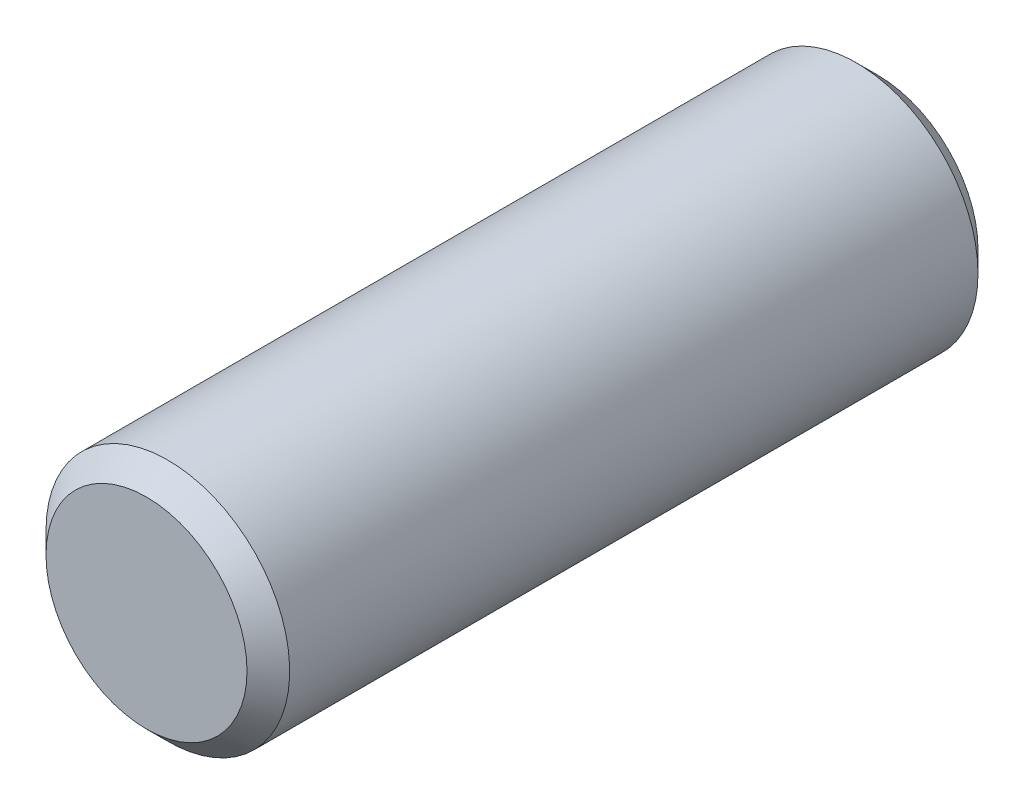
ISO-10303-21;
HEADER;
FILE_DESCRIPTION(('STEP AP214'),'2;1');
FILE_NAME('part.step','',(''),(''),'','','');
FILE_SCHEMA(('AUTOMOTIVE_DESIGN { 1 0 10303 214 1 1 1 1 }'));
ENDSEC;
DATA;
#1=APPLICATION_CONTEXT('core data for automotive mechanical design processes');
#2=APPLICATION_PROTOCOL_DEFINITION('international standard','automotive_design',2000,#1);
#3=PRODUCT_CONTEXT('',#1,'mechanical');
#4=PRODUCT('Part','Part','',(#3));
#5=PRODUCT_RELATED_PRODUCT_CATEGORY('part','',(#4));
#6=PRODUCT_DEFINITION_FORMATION('','',#4);
#7=PRODUCT_DEFINITION_CONTEXT('part definition',#1,'design');
#8=PRODUCT_DEFINITION('design','',#6,#7);
#9=PRODUCT_DEFINITION_SHAPE('','',#8);
#10=(LENGTH_UNIT() NAMED_UNIT(*) SI_UNIT(.MILLI.,.METRE.));
#11=(NAMED_UNIT(*) PLANE_ANGLE_UNIT() SI_UNIT($,.RADIAN.));
#12=(NAMED_UNIT(*) SI_UNIT($,.STERADIAN.) SOLID_ANGLE_UNIT());
#13=UNCERTAINTY_MEASURE_WITH_UNIT(LENGTH_MEASURE(1.E-05),#10,'distance_accuracy_value','');
#14=(GEOMETRIC_REPRESENTATION_CONTEXT(3) GLOBAL_UNCERTAINTY_ASSIGNED_CONTEXT((#13)) GLOBAL_UNIT_ASSIGNED_CONTEXT((#10,
#11,#12)) REPRESENTATION_CONTEXT('',''));
#15=CARTESIAN_POINT('',(0.,0.,0.));
#16=DIRECTION('',(0.,0.,1.));
#17=DIRECTION('',(1.,0.,0.));
#18=AXIS2_PLACEMENT_3D('',#15,#16,#17);
#19=CARTESIAN_POINT('',(0.,0.,12.));
#20=DIRECTION('',(0.,0.,-1.));
#21=DIRECTION('',(-1.,0.,0.));
#22=AXIS2_PLACEMENT_3D('',#19,#20,#21);
#23=CYLINDRICAL_SURFACE('',#22,2.);
#24=CARTESIAN_POINT('',(0.,0.,0.35));
#25=DIRECTION('',(0.,0.,1.));
#26=DIRECTION('',(1.,0.,0.));
#27=AXIS2_PLACEMENT_3D('',#24,#25,#26);
#28=CIRCLE('',#27,2.);
#29=CARTESIAN_POINT('',(-2.,0.,0.35));
#30=VERTEX_POINT('',#29);
#31=EDGE_CURVE('E39',#30,#30,#28,.T.);
#32=CARTESIAN_POINT('',(0.,0.,11.65));
#33=DIRECTION('',(0.,0.,1.));
#34=DIRECTION('',(1.,0.,0.));
#35=AXIS2_PLACEMENT_3D('',#32,#33,#34);
#36=CIRCLE('',#35,2.);
#37=CARTESIAN_POINT('',(-2.,0.,11.65));
#38=VERTEX_POINT('',#37);
#39=EDGE_CURVE('E43',#38,#38,#36,.F.);
#40=CARTESIAN_POINT('',(-2.,0.,0.35));
#41=CARTESIAN_POINT('',(-2.,0.,0.467708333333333));
#42=CARTESIAN_POINT('',(-2.,0.,0.585416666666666));
#43=CARTESIAN_POINT('',(-2.,0.,0.820833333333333));
#44=CARTESIAN_POINT('',(-2.,0.,0.938541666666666));
#45=CARTESIAN_POINT('',(-2.,0.,1.17395833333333));
#46=CARTESIAN_POINT('',(-2.,0.,1.29166666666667));
#47=CARTESIAN_POINT('',(-2.,0.,1.52708333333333));
#48=CARTESIAN_POINT('',(-2.,0.,1.64479166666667));
#49=CARTESIAN_POINT('',(-2.,0.,1.88020833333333));
#50=CARTESIAN_POINT('',(-2.,0.,1.99791666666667));
#51=CARTESIAN_POINT('',(-2.,0.,2.23333333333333));
#52=CARTESIAN_POINT('',(-2.,0.,2.35104166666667));
#53=CARTESIAN_POINT('',(-2.,0.,2.58645833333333));
#54=CARTESIAN_POINT('',(-2.,0.,2.70416666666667));
#55=CARTESIAN_POINT('',(-2.,0.,2.93958333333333));
#56=CARTESIAN_POINT('',(-2.,0.,3.05729166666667));
#57=CARTESIAN_POINT('',(-2.,0.,3.29270833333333));
#58=CARTESIAN_POINT('',(-2.,0.,3.41041666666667));
#59=CARTESIAN_POINT('',(-2.,0.,3.64583333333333));
#60=CARTESIAN_POINT('',(-2.,0.,3.76354166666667));
#61=CARTESIAN_POINT('',(-2.,0.,3.99895833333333));
#62=CARTESIAN_POINT('',(-2.,0.,4.11666666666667));
#63=CARTESIAN_POINT('',(-2.,0.,4.35208333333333));
#64=CARTESIAN_POINT('',(-2.,0.,4.46979166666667));
#65=CARTESIAN_POINT('',(-2.,0.,4.70520833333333));
#66=CARTESIAN_POINT('',(-2.,0.,4.82291666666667));
#67=CARTESIAN_POINT('',(-2.,0.,5.05833333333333));
#68=CARTESIAN_POINT('',(-2.,0.,5.17604166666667));
#69=CARTESIAN_POINT('',(-2.,0.,5.41145833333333));
#70=CARTESIAN_POINT('',(-2.,0.,5.52916666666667));
#71=CARTESIAN_POINT('',(-2.,0.,5.76458333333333));
#72=CARTESIAN_POINT('',(-2.,0.,5.88229166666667));
#73=CARTESIAN_POINT('',(-2.,0.,6.11770833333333));
#74=CARTESIAN_POINT('',(-2.,0.,6.23541666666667));
#75=CARTESIAN_POINT('',(-2.,0.,6.47083333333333));
#76=CARTESIAN_POINT('',(-2.,0.,6.58854166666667));
#77=CARTESIAN_POINT('',(-2.,0.,6.82395833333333));
#78=CARTESIAN_POINT('',(-2.,0.,6.94166666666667));
#79=CARTESIAN_POINT('',(-2.,0.,7.17708333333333));
#80=CARTESIAN_POINT('',(-2.,0.,7.29479166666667));
#81=CARTESIAN_POINT('',(-2.,0.,7.53020833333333));
#82=CARTESIAN_POINT('',(-2.,0.,7.64791666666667));
#83=CARTESIAN_POINT('',(-2.,0.,7.88333333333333));
#84=CARTESIAN_POINT('',(-2.,0.,8.00104166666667));
#85=CARTESIAN_POINT('',(-2.,0.,8.23645833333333));
#86=CARTESIAN_POINT('',(-2.,0.,8.35416666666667));
#87=CARTESIAN_POINT('',(-2.,0.,8.58958333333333));
#88=CARTESIAN_POINT('',(-2.,0.,8.70729166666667));
#89=CARTESIAN_POINT('',(-2.,0.,8.94270833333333));
#90=CARTESIAN_POINT('',(-2.,0.,9.06041666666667));
#91=CARTESIAN_POINT('',(-2.,0.,9.29583333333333));
#92=CARTESIAN_POINT('',(-2.,0.,9.41354166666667));
#93=CARTESIAN_POINT('',(-2.,0.,9.64895833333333));
#94=CARTESIAN_POINT('',(-2.,0.,9.76666666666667));
#95=CARTESIAN_POINT('',(-2.,0.,10.0020833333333));
#96=CARTESIAN_POINT('',(-2.,0.,10.1197916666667));
#97=CARTESIAN_POINT('',(-2.,0.,10.3552083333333));
#98=CARTESIAN_POINT('',(-2.,0.,10.4729166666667));
#99=CARTESIAN_POINT('',(-2.,0.,10.7083333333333));
#100=CARTESIAN_POINT('',(-2.,0.,10.8260416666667));
#101=CARTESIAN_POINT('',(-2.,0.,11.0614583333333));
#102=CARTESIAN_POINT('',(-2.,0.,11.1791666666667));
#103=CARTESIAN_POINT('',(-2.,0.,11.4145833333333));
#104=CARTESIAN_POINT('',(-2.,0.,11.5322916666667));
#105=CARTESIAN_POINT('',(-2.,0.,11.65));
#106=B_SPLINE_CURVE_WITH_KNOTS('',3,(#40,#41,#42,#43,#44,#45,#46,#47,#48,#49,#50,#51,#52,#53,
#54,#55,#56,#57,#58,#59,#60,#61,#62,#63,#64,#65,#66,#67,#68,#69,#70,#71,#72,#73,#74,#75,#76,#77,
#78,#79,#80,#81,#82,#83,#84,#85,#86,#87,#88,#89,#90,#91,#92,#93,#94,#95,#96,#97,#98,#99,#100,
#101,#102,#103,#104,#105),.UNSPECIFIED.,.F.,.F.,(4,2,2,2,2,2,2,2,2,2,2,2,2,2,2,2,2,2,2,2,2,2,2,
2,2,2,2,2,2,2,2,2,4),(0.,0.353124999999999,0.70625,1.059375,1.4125,1.765625,2.11875,2.471875,
2.825,3.178125,3.53125,3.884375,4.2375,4.590625,4.94375,5.296875,5.65,6.003125,6.35625,6.709375,
7.0625,7.415625,7.76875,8.121875,8.475,8.828125,9.18125,9.534375,9.8875,10.240625,10.59375,
10.946875,11.3),.UNSPECIFIED.);
#107=EDGE_CURVE('BSEAM28',#30,#38,#106,.T.);
#108=ORIENTED_EDGE('',*,*,#31,.T.);
#109=ORIENTED_EDGE('',*,*,#39,.T.);
#110=ORIENTED_EDGE('',*,*,#107,.T.);
#111=ORIENTED_EDGE('',*,*,#107,.F.);
#112=EDGE_LOOP('',(#108,#110,#109,#111));
#113=FACE_BOUND('',#112,.T.);
#114=ADVANCED_FACE('F28',(#113),#23,.T.);
#115=CARTESIAN_POINT('',(0.,0.,12.));
#116=DIRECTION('',(0.,0.,1.));
#117=DIRECTION('',(1.,0.,0.));
#118=AXIS2_PLACEMENT_3D('',#115,#116,#117);
#119=PLANE('',#118);
#120=CARTESIAN_POINT('',(0.,0.,12.));
#121=DIRECTION('',(0.,0.,1.));
#122=DIRECTION('',(1.,0.,0.));
#123=AXIS2_PLACEMENT_3D('',#120,#121,#122);
#124=CIRCLE('',#123,1.65);
#125=CARTESIAN_POINT('',(-1.65,0.,12.));
#126=VERTEX_POINT('',#125);
#127=EDGE_CURVE('E10',#126,#126,#124,.T.);
#128=ORIENTED_EDGE('',*,*,#127,.T.);
#129=EDGE_LOOP('',(#128));
#130=FACE_BOUND('',#129,.T.);
#131=ADVANCED_FACE('F59',(#130),#119,.T.);
#132=CARTESIAN_POINT('',(0.,0.,0.));
#133=DIRECTION('',(0.,0.,1.));
#134=DIRECTION('',(1.,0.,0.));
#135=AXIS2_PLACEMENT_3D('',#132,#133,#134);
#136=PLANE('',#135);
#137=CARTESIAN_POINT('',(0.,0.,0.));
#138=DIRECTION('',(0.,0.,1.));
#139=DIRECTION('',(1.,0.,0.));
#140=AXIS2_PLACEMENT_3D('',#137,#138,#139);
#141=CIRCLE('',#140,1.65);
#142=CARTESIAN_POINT('',(1.65,0.,0.));
#143=VERTEX_POINT('',#142);
#144=EDGE_CURVE('E35',#143,#143,#141,.F.);
#145=ORIENTED_EDGE('',*,*,#144,.T.);
#146=EDGE_LOOP('',(#145));
#147=FACE_BOUND('',#146,.T.);
#148=ADVANCED_FACE('F56',(#147),#136,.F.);
#149=CARTESIAN_POINT('',(0.,0.,0.35));
#150=DIRECTION('',(0.,0.,1.));
#151=DIRECTION('',(1.,0.,0.));
#152=AXIS2_PLACEMENT_3D('',#149,#150,#151);
#153=CONICAL_SURFACE('',#152,2.,0.785398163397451);
#154=ORIENTED_EDGE('',*,*,#144,.F.);
#155=EDGE_LOOP('',(#154));
#156=FACE_BOUND('',#155,.T.);
#157=ORIENTED_EDGE('',*,*,#31,.F.);
#158=EDGE_LOOP('',(#157));
#159=FACE_BOUND('',#158,.T.);
#160=ADVANCED_FACE('F52',(#156,#159),#153,.T.);
#161=CARTESIAN_POINT('',(0.,0.,12.));
#162=DIRECTION('',(0.,0.,-1.));
#163=DIRECTION('',(-1.,0.,0.));
#164=AXIS2_PLACEMENT_3D('',#161,#162,#163);
#165=CONICAL_SURFACE('',#164,1.65,0.785398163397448);
#166=CARTESIAN_POINT('',(-2.,0.,11.65));
#167=CARTESIAN_POINT('',(-1.99635416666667,0.,11.6536458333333));
#168=CARTESIAN_POINT('',(-1.99270833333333,0.,11.6572916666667));
#169=CARTESIAN_POINT('',(-1.98541666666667,0.,11.6645833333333));
#170=CARTESIAN_POINT('',(-1.98177083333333,0.,11.6682291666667));
#171=CARTESIAN_POINT('',(-1.97447916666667,0.,11.6755208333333));
#172=CARTESIAN_POINT('',(-1.97083333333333,0.,11.6791666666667));
#173=CARTESIAN_POINT('',(-1.96354166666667,0.,11.6864583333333));
#174=CARTESIAN_POINT('',(-1.95989583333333,0.,11.6901041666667));
#175=CARTESIAN_POINT('',(-1.95260416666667,0.,11.6973958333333));
#176=CARTESIAN_POINT('',(-1.94895833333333,0.,11.7010416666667));
#177=CARTESIAN_POINT('',(-1.94166666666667,0.,11.7083333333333));
#178=CARTESIAN_POINT('',(-1.93802083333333,0.,11.7119791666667));
#179=CARTESIAN_POINT('',(-1.93072916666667,0.,11.7192708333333));
#180=CARTESIAN_POINT('',(-1.92708333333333,0.,11.7229166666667));
#181=CARTESIAN_POINT('',(-1.91979166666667,0.,11.7302083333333));
#182=CARTESIAN_POINT('',(-1.91614583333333,0.,11.7338541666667));
#183=CARTESIAN_POINT('',(-1.90885416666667,0.,11.7411458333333));
#184=CARTESIAN_POINT('',(-1.90520833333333,0.,11.7447916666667));
#185=CARTESIAN_POINT('',(-1.89791666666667,0.,11.7520833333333));
#186=CARTESIAN_POINT('',(-1.89427083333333,0.,11.7557291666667));
#187=CARTESIAN_POINT('',(-1.88697916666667,0.,11.7630208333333));
#188=CARTESIAN_POINT('',(-1.88333333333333,0.,11.7666666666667));
#189=CARTESIAN_POINT('',(-1.87604166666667,0.,11.7739583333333));
#190=CARTESIAN_POINT('',(-1.87239583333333,0.,11.7776041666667));
#191=CARTESIAN_POINT('',(-1.86510416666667,0.,11.7848958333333));
#192=CARTESIAN_POINT('',(-1.86145833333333,0.,11.7885416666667));
#193=CARTESIAN_POINT('',(-1.85416666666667,0.,11.7958333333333));
#194=CARTESIAN_POINT('',(-1.85052083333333,0.,11.7994791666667));
#195=CARTESIAN_POINT('',(-1.84322916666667,0.,11.8067708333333));
#196=CARTESIAN_POINT('',(-1.83958333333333,0.,11.8104166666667));
#197=CARTESIAN_POINT('',(-1.83229166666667,0.,11.8177083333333));
#198=CARTESIAN_POINT('',(-1.82864583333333,0.,11.8213541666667));
#199=CARTESIAN_POINT('',(-1.82135416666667,0.,11.8286458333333));
#200=CARTESIAN_POINT('',(-1.81770833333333,0.,11.8322916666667));
#201=CARTESIAN_POINT('',(-1.81041666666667,0.,11.8395833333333));
#202=CARTESIAN_POINT('',(-1.80677083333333,0.,11.8432291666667));
#203=CARTESIAN_POINT('',(-1.79947916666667,0.,11.8505208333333));
#204=CARTESIAN_POINT('',(-1.79583333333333,0.,11.8541666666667));
#205=CARTESIAN_POINT('',(-1.78854166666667,0.,11.8614583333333));
#206=CARTESIAN_POINT('',(-1.78489583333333,0.,11.8651041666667));
#207=CARTESIAN_POINT('',(-1.77760416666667,0.,11.8723958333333));
#208=CARTESIAN_POINT('',(-1.77395833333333,0.,11.8760416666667));
#209=CARTESIAN_POINT('',(-1.76666666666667,0.,11.8833333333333));
#210=CARTESIAN_POINT('',(-1.76302083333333,0.,11.8869791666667));
#211=CARTESIAN_POINT('',(-1.75572916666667,0.,11.8942708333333));
#212=CARTESIAN_POINT('',(-1.75208333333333,0.,11.8979166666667));
#213=CARTESIAN_POINT('',(-1.74479166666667,0.,11.9052083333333));
#214=CARTESIAN_POINT('',(-1.74114583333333,0.,11.9088541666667));
#215=CARTESIAN_POINT('',(-1.73385416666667,0.,11.9161458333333));
#216=CARTESIAN_POINT('',(-1.73020833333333,0.,11.9197916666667));
#217=CARTESIAN_POINT('',(-1.72291666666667,0.,11.9270833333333));
#218=CARTESIAN_POINT('',(-1.71927083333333,0.,11.9307291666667));
#219=CARTESIAN_POINT('',(-1.71197916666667,0.,11.9380208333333));
#220=CARTESIAN_POINT('',(-1.70833333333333,0.,11.9416666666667));
#221=CARTESIAN_POINT('',(-1.70104166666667,0.,11.9489583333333));
#222=CARTESIAN_POINT('',(-1.69739583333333,0.,11.9526041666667));
#223=CARTESIAN_POINT('',(-1.69010416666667,0.,11.9598958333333));
#224=CARTESIAN_POINT('',(-1.68645833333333,0.,11.9635416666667));
#225=CARTESIAN_POINT('',(-1.67916666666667,0.,11.9708333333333));
#226=CARTESIAN_POINT('',(-1.67552083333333,0.,11.9744791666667));
#227=CARTESIAN_POINT('',(-1.66822916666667,0.,11.9817708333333));
#228=CARTESIAN_POINT('',(-1.66458333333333,0.,11.9854166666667));
#229=CARTESIAN_POINT('',(-1.65729166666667,0.,11.9927083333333));
#230=CARTESIAN_POINT('',(-1.65364583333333,0.,11.9963541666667));
#231=CARTESIAN_POINT('',(-1.65,0.,12.));
#232=B_SPLINE_CURVE_WITH_KNOTS('',3,(#166,#167,#168,#169,#170,#171,#172,#173,#174,#175,#176,
#177,#178,#179,#180,#181,#182,#183,#184,#185,#186,#187,#188,#189,#190,#191,#192,#193,#194,#195,
#196,#197,#198,#199,#200,#201,#202,#203,#204,#205,#206,#207,#208,#209,#210,#211,#212,#213,#214,
#215,#216,#217,#218,#219,#220,#221,#222,#223,#224,#225,#226,#227,#228,#229,#230,#231),
.UNSPECIFIED.,.F.,.F.,(4,2,2,2,2,2,2,2,2,2,2,2,2,2,2,2,2,2,2,2,2,2,2,2,2,2,2,2,2,2,2,2,4),(0.,
0.0154679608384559,0.030935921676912,0.0464038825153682,0.0618718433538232,0.0773398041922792,
0.0928077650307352,0.10827572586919,0.123743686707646,0.139211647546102,0.154679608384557,
0.170147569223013,0.185615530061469,0.201083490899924,0.21655145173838,0.232019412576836,
0.247487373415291,0.262955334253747,0.278423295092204,0.29389125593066,0.309359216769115,
0.324827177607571,0.340295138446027,0.355763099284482,0.371231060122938,0.386699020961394,
0.402166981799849,0.417634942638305,0.433102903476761,0.448570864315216,0.464038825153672,
0.479506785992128,0.494974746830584),.UNSPECIFIED.);
#233=EDGE_CURVE('BSEAM30',#38,#126,#232,.T.);
#234=ORIENTED_EDGE('',*,*,#39,.F.);
#235=ORIENTED_EDGE('',*,*,#127,.F.);
#236=ORIENTED_EDGE('',*,*,#233,.T.);
#237=ORIENTED_EDGE('',*,*,#233,.F.);
#238=EDGE_LOOP('',(#234,#236,#235,#237));
#239=FACE_BOUND('',#238,.T.);
#240=ADVANCED_FACE('F30',(#239),#165,.T.);
#241=CLOSED_SHELL('',(#114,#131,#148,#160,#240));
#242=MANIFOLD_SOLID_BREP('B2',#241);
#243=ADVANCED_BREP_SHAPE_REPRESENTATION('',(#18,#242),#14);
#244=SHAPE_DEFINITION_REPRESENTATION(#9,#243);
ENDSEC;
END-ISO-10303-21;
